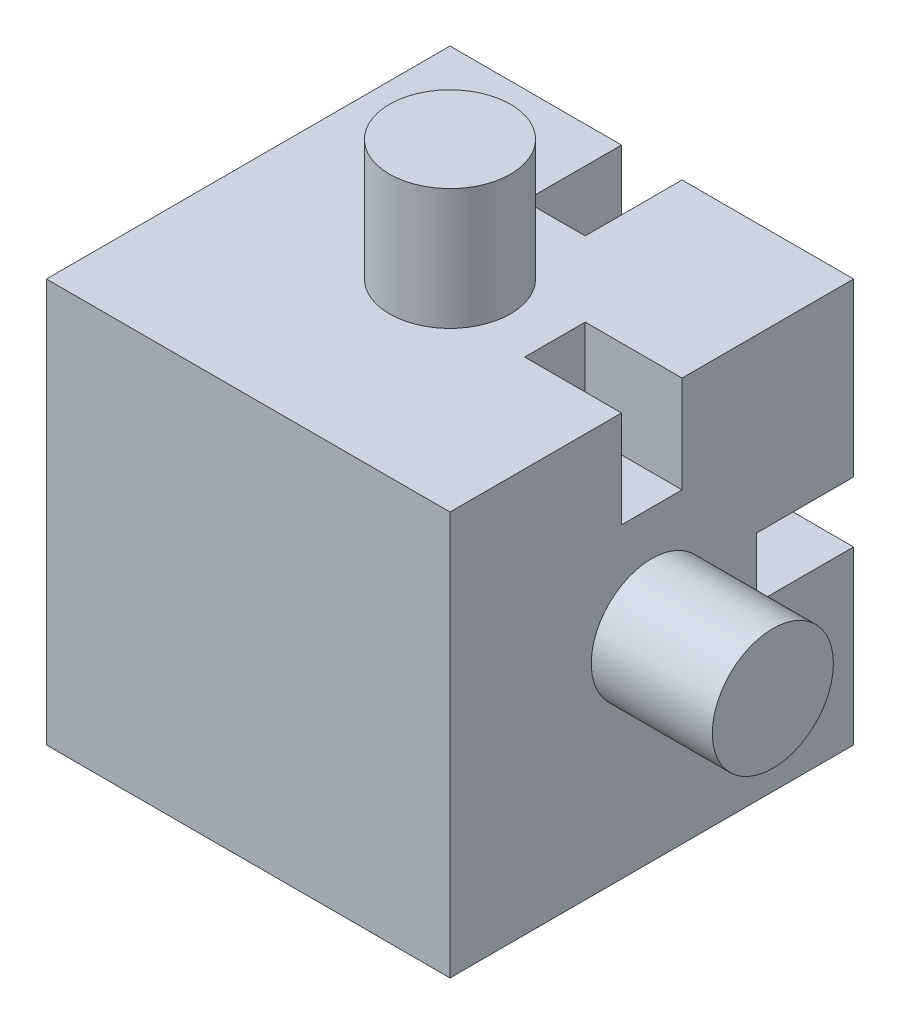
ISO-10303-21;
HEADER;
FILE_DESCRIPTION(('STEP AP214'),'2;1');
FILE_NAME('part.step','',(''),(''),'','','');
FILE_SCHEMA(('AUTOMOTIVE_DESIGN { 1 0 10303 214 1 1 1 1 }'));
ENDSEC;
DATA;
#1=APPLICATION_CONTEXT('core data for automotive mechanical design processes');
#2=APPLICATION_PROTOCOL_DEFINITION('international standard','automotive_design',2000,#1);
#3=PRODUCT_CONTEXT('',#1,'mechanical');
#4=PRODUCT('Part','Part','',(#3));
#5=PRODUCT_RELATED_PRODUCT_CATEGORY('part','',(#4));
#6=PRODUCT_DEFINITION_FORMATION('','',#4);
#7=PRODUCT_DEFINITION_CONTEXT('part definition',#1,'design');
#8=PRODUCT_DEFINITION('design','',#6,#7);
#9=PRODUCT_DEFINITION_SHAPE('','',#8);
#10=(LENGTH_UNIT() NAMED_UNIT(*) SI_UNIT(.MILLI.,.METRE.));
#11=(NAMED_UNIT(*) PLANE_ANGLE_UNIT() SI_UNIT($,.RADIAN.));
#12=(NAMED_UNIT(*) SI_UNIT($,.STERADIAN.) SOLID_ANGLE_UNIT());
#13=UNCERTAINTY_MEASURE_WITH_UNIT(LENGTH_MEASURE(1.E-05),#10,'distance_accuracy_value','');
#14=(GEOMETRIC_REPRESENTATION_CONTEXT(3) GLOBAL_UNCERTAINTY_ASSIGNED_CONTEXT((#13)) GLOBAL_UNIT_ASSIGNED_CONTEXT((#10,
#11,#12)) REPRESENTATION_CONTEXT('',''));
#15=CARTESIAN_POINT('',(0.,0.,0.));
#16=DIRECTION('',(0.,0.,1.));
#17=DIRECTION('',(1.,0.,0.));
#18=AXIS2_PLACEMENT_3D('',#15,#16,#17);
#19=CARTESIAN_POINT('',(0.,0.,-10.));
#20=DIRECTION('',(0.,0.,-1.));
#21=DIRECTION('',(-1.,0.,0.));
#22=AXIS2_PLACEMENT_3D('',#19,#20,#21);
#23=PLANE('',#22);
#24=CARTESIAN_POINT('',(0.,0.,-10.));
#25=DIRECTION('',(0.,0.,-1.));
#26=DIRECTION('',(-1.,0.,0.));
#27=AXIS2_PLACEMENT_3D('',#24,#25,#26);
#28=CIRCLE('',#27,3.);
#29=CARTESIAN_POINT('',(-3.,0.,-10.));
#30=VERTEX_POINT('',#29);
#31=EDGE_CURVE('E237',#30,#30,#28,.T.);
#32=ORIENTED_EDGE('',*,*,#31,.F.);
#33=EDGE_LOOP('',(#32));
#34=FACE_BOUND('',#33,.T.);
#35=DIRECTION('',(-1.,0.,0.));
#36=VECTOR('',#35,1.);
#37=CARTESIAN_POINT('',(1.5,5.2,-10.));
#38=LINE('',#37,#36);
#39=CARTESIAN_POINT('',(1.5,5.2,-10.));
#40=VERTEX_POINT('',#39);
#41=CARTESIAN_POINT('',(-1.5,5.2,-10.));
#42=VERTEX_POINT('',#41);
#43=EDGE_CURVE('E172',#40,#42,#38,.T.);
#44=ORIENTED_EDGE('',*,*,#43,.F.);
#45=DIRECTION('',(0.,1.,0.));
#46=VECTOR('',#45,1.);
#47=CARTESIAN_POINT('',(1.5,10.,-10.));
#48=LINE('',#47,#46);
#49=CARTESIAN_POINT('',(1.5,10.,-10.));
#50=VERTEX_POINT('',#49);
#51=EDGE_CURVE('E307',#40,#50,#48,.T.);
#52=ORIENTED_EDGE('',*,*,#51,.T.);
#53=DIRECTION('',(-1.,0.,0.));
#54=VECTOR('',#53,1.);
#55=CARTESIAN_POINT('',(-10.,10.,-10.));
#56=LINE('',#55,#54);
#57=CARTESIAN_POINT('',(10.,10.,-10.));
#58=VERTEX_POINT('',#57);
#59=EDGE_CURVE('E262',#58,#50,#56,.T.);
#60=ORIENTED_EDGE('',*,*,#59,.F.);
#61=DIRECTION('',(0.,1.,0.));
#62=VECTOR('',#61,1.);
#63=CARTESIAN_POINT('',(10.,-10.,-10.));
#64=LINE('',#63,#62);
#65=CARTESIAN_POINT('',(10.,1.5,-10.));
#66=VERTEX_POINT('',#65);
#67=EDGE_CURVE('E257',#66,#58,#64,.T.);
#68=ORIENTED_EDGE('',*,*,#67,.F.);
#69=DIRECTION('',(-1.,0.,0.));
#70=VECTOR('',#69,1.);
#71=CARTESIAN_POINT('',(10.,1.5,-10.));
#72=LINE('',#71,#70);
#73=CARTESIAN_POINT('',(5.2,1.5,-10.));
#74=VERTEX_POINT('',#73);
#75=EDGE_CURVE('E185',#66,#74,#72,.T.);
#76=ORIENTED_EDGE('',*,*,#75,.T.);
#77=DIRECTION('',(0.,-1.,0.));
#78=VECTOR('',#77,1.);
#79=CARTESIAN_POINT('',(5.2,1.5,-10.));
#80=LINE('',#79,#78);
#81=CARTESIAN_POINT('',(5.2,-1.5,-10.));
#82=VERTEX_POINT('',#81);
#83=EDGE_CURVE('E196',#74,#82,#80,.T.);
#84=ORIENTED_EDGE('',*,*,#83,.T.);
#85=DIRECTION('',(-1.,0.,0.));
#86=VECTOR('',#85,1.);
#87=CARTESIAN_POINT('',(10.,-1.5,-10.));
#88=LINE('',#87,#86);
#89=CARTESIAN_POINT('',(10.,-1.5,-10.));
#90=VERTEX_POINT('',#89);
#91=EDGE_CURVE('E170',#90,#82,#88,.T.);
#92=ORIENTED_EDGE('',*,*,#91,.F.);
#93=CARTESIAN_POINT('',(10.,-10.,-10.));
#94=VERTEX_POINT('',#93);
#95=EDGE_CURVE('E258',#94,#90,#64,.T.);
#96=ORIENTED_EDGE('',*,*,#95,.F.);
#97=DIRECTION('',(1.,0.,0.));
#98=VECTOR('',#97,1.);
#99=CARTESIAN_POINT('',(-10.,-10.,-10.));
#100=LINE('',#99,#98);
#101=CARTESIAN_POINT('',(-10.,-10.,-10.));
#102=VERTEX_POINT('',#101);
#103=EDGE_CURVE('E267',#102,#94,#100,.T.);
#104=ORIENTED_EDGE('',*,*,#103,.F.);
#105=DIRECTION('',(0.,-1.,0.));
#106=VECTOR('',#105,1.);
#107=CARTESIAN_POINT('',(-10.,-10.,-10.));
#108=LINE('',#107,#106);
#109=CARTESIAN_POINT('',(-10.,10.,-10.));
#110=VERTEX_POINT('',#109);
#111=EDGE_CURVE('E264',#110,#102,#108,.T.);
#112=ORIENTED_EDGE('',*,*,#111,.F.);
#113=CARTESIAN_POINT('',(-1.5,10.,-10.));
#114=VERTEX_POINT('',#113);
#115=EDGE_CURVE('E261',#114,#110,#56,.T.);
#116=ORIENTED_EDGE('',*,*,#115,.F.);
#117=DIRECTION('',(0.,1.,0.));
#118=VECTOR('',#117,1.);
#119=CARTESIAN_POINT('',(-1.5,10.,-10.));
#120=LINE('',#119,#118);
#121=EDGE_CURVE('E50',#42,#114,#120,.T.);
#122=ORIENTED_EDGE('',*,*,#121,.F.);
#123=EDGE_LOOP('',(#44,#52,#60,#68,#76,#84,#92,#96,#104,#112,#116,#122));
#124=FACE_BOUND('',#123,.T.);
#125=ADVANCED_FACE('F33',(#34,#124),#23,.T.);
#126=CARTESIAN_POINT('',(-10.,10.,-10.));
#127=DIRECTION('',(0.,1.,0.));
#128=DIRECTION('',(0.,0.,1.));
#129=AXIS2_PLACEMENT_3D('',#126,#127,#128);
#130=PLANE('',#129);
#131=CARTESIAN_POINT('',(0.,10.,0.));
#132=DIRECTION('',(0.,1.,0.));
#133=DIRECTION('',(0.,0.,1.));
#134=AXIS2_PLACEMENT_3D('',#131,#132,#133);
#135=CIRCLE('',#134,3.);
#136=CARTESIAN_POINT('',(0.,10.,3.));
#137=VERTEX_POINT('',#136);
#138=EDGE_CURVE('E231',#137,#137,#135,.T.);
#139=ORIENTED_EDGE('',*,*,#138,.F.);
#140=EDGE_LOOP('',(#139));
#141=FACE_BOUND('',#140,.T.);
#142=ORIENTED_EDGE('',*,*,#59,.T.);
#143=DIRECTION('',(0.,0.,1.));
#144=VECTOR('',#143,1.);
#145=CARTESIAN_POINT('',(1.5,10.,-10.));
#146=LINE('',#145,#144);
#147=CARTESIAN_POINT('',(1.5,10.,-5.2));
#148=VERTEX_POINT('',#147);
#149=EDGE_CURVE('E168',#50,#148,#146,.T.);
#150=ORIENTED_EDGE('',*,*,#149,.T.);
#151=DIRECTION('',(-1.,0.,0.));
#152=VECTOR('',#151,1.);
#153=CARTESIAN_POINT('',(1.5,10.,-5.2));
#154=LINE('',#153,#152);
#155=CARTESIAN_POINT('',(-1.5,10.,-5.2));
#156=VERTEX_POINT('',#155);
#157=EDGE_CURVE('E153',#148,#156,#154,.T.);
#158=ORIENTED_EDGE('',*,*,#157,.T.);
#159=DIRECTION('',(0.,0.,1.));
#160=VECTOR('',#159,1.);
#161=CARTESIAN_POINT('',(-1.5,10.,-10.));
#162=LINE('',#161,#160);
#163=EDGE_CURVE('E159',#114,#156,#162,.T.);
#164=ORIENTED_EDGE('',*,*,#163,.F.);
#165=ORIENTED_EDGE('',*,*,#115,.T.);
#166=DIRECTION('',(0.,0.,1.));
#167=VECTOR('',#166,1.);
#168=CARTESIAN_POINT('',(-10.,10.,-10.));
#169=LINE('',#168,#167);
#170=CARTESIAN_POINT('',(-10.,10.,10.));
#171=VERTEX_POINT('',#170);
#172=EDGE_CURVE('E271',#110,#171,#169,.T.);
#173=ORIENTED_EDGE('',*,*,#172,.T.);
#174=DIRECTION('',(-1.,0.,0.));
#175=VECTOR('',#174,1.);
#176=CARTESIAN_POINT('',(-10.,10.,10.));
#177=LINE('',#176,#175);
#178=CARTESIAN_POINT('',(10.,10.,10.));
#179=VERTEX_POINT('',#178);
#180=EDGE_CURVE('E248',#179,#171,#177,.T.);
#181=ORIENTED_EDGE('',*,*,#180,.F.);
#182=DIRECTION('',(0.,0.,1.));
#183=VECTOR('',#182,1.);
#184=CARTESIAN_POINT('',(10.,10.,-10.));
#185=LINE('',#184,#183);
#186=CARTESIAN_POINT('',(10.,10.,1.5));
#187=VERTEX_POINT('',#186);
#188=EDGE_CURVE('E269',#187,#179,#185,.T.);
#189=ORIENTED_EDGE('',*,*,#188,.F.);
#190=DIRECTION('',(-1.,0.,0.));
#191=VECTOR('',#190,1.);
#192=CARTESIAN_POINT('',(10.,10.,1.5));
#193=LINE('',#192,#191);
#194=CARTESIAN_POINT('',(5.2,10.,1.5));
#195=VERTEX_POINT('',#194);
#196=EDGE_CURVE('E213',#187,#195,#193,.T.);
#197=ORIENTED_EDGE('',*,*,#196,.T.);
#198=DIRECTION('',(0.,0.,-1.));
#199=VECTOR('',#198,1.);
#200=CARTESIAN_POINT('',(5.2,10.,1.5));
#201=LINE('',#200,#199);
#202=CARTESIAN_POINT('',(5.2,10.,-1.5));
#203=VERTEX_POINT('',#202);
#204=EDGE_CURVE('E224',#195,#203,#201,.T.);
#205=ORIENTED_EDGE('',*,*,#204,.T.);
#206=DIRECTION('',(-1.,0.,0.));
#207=VECTOR('',#206,1.);
#208=CARTESIAN_POINT('',(10.,10.,-1.5));
#209=LINE('',#208,#207);
#210=CARTESIAN_POINT('',(10.,10.,-1.5));
#211=VERTEX_POINT('',#210);
#212=EDGE_CURVE('E201',#211,#203,#209,.T.);
#213=ORIENTED_EDGE('',*,*,#212,.F.);
#214=EDGE_CURVE('E37',#58,#211,#185,.T.);
#215=ORIENTED_EDGE('',*,*,#214,.F.);
#216=EDGE_LOOP('',(#142,#150,#158,#164,#165,#173,#181,#189,#197,#205,#213,#215));
#217=FACE_BOUND('',#216,.T.);
#218=ADVANCED_FACE('F167',(#141,#217),#130,.T.);
#219=CARTESIAN_POINT('',(10.,-10.,-10.));
#220=DIRECTION('',(1.,0.,0.));
#221=DIRECTION('',(0.,0.,-1.));
#222=AXIS2_PLACEMENT_3D('',#219,#220,#221);
#223=PLANE('',#222);
#224=CARTESIAN_POINT('',(10.,0.,0.));
#225=DIRECTION('',(1.,0.,0.));
#226=DIRECTION('',(0.,0.,-1.));
#227=AXIS2_PLACEMENT_3D('',#224,#225,#226);
#228=CIRCLE('',#227,3.);
#229=CARTESIAN_POINT('',(10.,0.,-3.));
#230=VERTEX_POINT('',#229);
#231=EDGE_CURVE('E227',#230,#230,#228,.T.);
#232=ORIENTED_EDGE('',*,*,#231,.F.);
#233=EDGE_LOOP('',(#232));
#234=FACE_BOUND('',#233,.T.);
#235=DIRECTION('',(0.,-1.,0.));
#236=VECTOR('',#235,1.);
#237=CARTESIAN_POINT('',(10.,1.5,-5.2));
#238=LINE('',#237,#236);
#239=CARTESIAN_POINT('',(10.,1.5,-5.2));
#240=VERTEX_POINT('',#239);
#241=CARTESIAN_POINT('',(10.,-1.5,-5.2));
#242=VERTEX_POINT('',#241);
#243=EDGE_CURVE('E192',#240,#242,#238,.T.);
#244=ORIENTED_EDGE('',*,*,#243,.F.);
#245=DIRECTION('',(0.,0.,-1.));
#246=VECTOR('',#245,1.);
#247=CARTESIAN_POINT('',(10.,1.5,-10.));
#248=LINE('',#247,#246);
#249=EDGE_CURVE('E182',#240,#66,#248,.T.);
#250=ORIENTED_EDGE('',*,*,#249,.T.);
#251=ORIENTED_EDGE('',*,*,#67,.T.);
#252=ORIENTED_EDGE('',*,*,#214,.T.);
#253=DIRECTION('',(0.,1.,0.));
#254=VECTOR('',#253,1.);
#255=CARTESIAN_POINT('',(10.,10.,-1.5));
#256=LINE('',#255,#254);
#257=CARTESIAN_POINT('',(10.,5.2,-1.5));
#258=VERTEX_POINT('',#257);
#259=EDGE_CURVE('E199',#258,#211,#256,.T.);
#260=ORIENTED_EDGE('',*,*,#259,.F.);
#261=DIRECTION('',(0.,0.,-1.));
#262=VECTOR('',#261,1.);
#263=CARTESIAN_POINT('',(10.,5.2,1.5));
#264=LINE('',#263,#262);
#265=CARTESIAN_POINT('',(10.,5.2,1.5));
#266=VERTEX_POINT('',#265);
#267=EDGE_CURVE('E220',#266,#258,#264,.T.);
#268=ORIENTED_EDGE('',*,*,#267,.F.);
#269=DIRECTION('',(0.,1.,0.));
#270=VECTOR('',#269,1.);
#271=CARTESIAN_POINT('',(10.,10.,1.5));
#272=LINE('',#271,#270);
#273=EDGE_CURVE('E210',#266,#187,#272,.T.);
#274=ORIENTED_EDGE('',*,*,#273,.T.);
#275=ORIENTED_EDGE('',*,*,#188,.T.);
#276=DIRECTION('',(0.,1.,0.));
#277=VECTOR('',#276,1.);
#278=CARTESIAN_POINT('',(10.,-10.,10.));
#279=LINE('',#278,#277);
#280=CARTESIAN_POINT('',(10.,-10.,10.));
#281=VERTEX_POINT('',#280);
#282=EDGE_CURVE('E243',#281,#179,#279,.T.);
#283=ORIENTED_EDGE('',*,*,#282,.F.);
#284=DIRECTION('',(0.,0.,1.));
#285=VECTOR('',#284,1.);
#286=CARTESIAN_POINT('',(10.,-10.,-10.));
#287=LINE('',#286,#285);
#288=EDGE_CURVE('E11',#94,#281,#287,.T.);
#289=ORIENTED_EDGE('',*,*,#288,.F.);
#290=ORIENTED_EDGE('',*,*,#95,.T.);
#291=DIRECTION('',(0.,0.,-1.));
#292=VECTOR('',#291,1.);
#293=CARTESIAN_POINT('',(10.,-1.5,-10.));
#294=LINE('',#293,#292);
#295=EDGE_CURVE('E58',#242,#90,#294,.T.);
#296=ORIENTED_EDGE('',*,*,#295,.F.);
#297=EDGE_LOOP('',(#244,#250,#251,#252,#260,#268,#274,#275,#283,#289,#290,#296));
#298=FACE_BOUND('',#297,.T.);
#299=ADVANCED_FACE('F35',(#234,#298),#223,.T.);
#300=CARTESIAN_POINT('',(-10.,-10.,-10.));
#301=DIRECTION('',(0.,-1.,0.));
#302=DIRECTION('',(0.,0.,-1.));
#303=AXIS2_PLACEMENT_3D('',#300,#301,#302);
#304=PLANE('',#303);
#305=ORIENTED_EDGE('',*,*,#288,.T.);
#306=DIRECTION('',(1.,0.,0.));
#307=VECTOR('',#306,1.);
#308=CARTESIAN_POINT('',(-10.,-10.,10.));
#309=LINE('',#308,#307);
#310=CARTESIAN_POINT('',(-10.,-10.,10.));
#311=VERTEX_POINT('',#310);
#312=EDGE_CURVE('E254',#311,#281,#309,.T.);
#313=ORIENTED_EDGE('',*,*,#312,.F.);
#314=DIRECTION('',(0.,0.,1.));
#315=VECTOR('',#314,1.);
#316=CARTESIAN_POINT('',(-10.,-10.,-10.));
#317=LINE('',#316,#315);
#318=EDGE_CURVE('E42',#102,#311,#317,.T.);
#319=ORIENTED_EDGE('',*,*,#318,.F.);
#320=ORIENTED_EDGE('',*,*,#103,.T.);
#321=EDGE_LOOP('',(#305,#313,#319,#320));
#322=FACE_BOUND('',#321,.T.);
#323=ADVANCED_FACE('F288',(#322),#304,.T.);
#324=CARTESIAN_POINT('',(-10.,-10.,-10.));
#325=DIRECTION('',(-1.,0.,0.));
#326=DIRECTION('',(0.,0.,1.));
#327=AXIS2_PLACEMENT_3D('',#324,#325,#326);
#328=PLANE('',#327);
#329=ORIENTED_EDGE('',*,*,#318,.T.);
#330=DIRECTION('',(0.,-1.,0.));
#331=VECTOR('',#330,1.);
#332=CARTESIAN_POINT('',(-10.,-10.,10.));
#333=LINE('',#332,#331);
#334=EDGE_CURVE('E251',#171,#311,#333,.T.);
#335=ORIENTED_EDGE('',*,*,#334,.F.);
#336=ORIENTED_EDGE('',*,*,#172,.F.);
#337=ORIENTED_EDGE('',*,*,#111,.T.);
#338=EDGE_LOOP('',(#329,#335,#336,#337));
#339=FACE_BOUND('',#338,.T.);
#340=ADVANCED_FACE('F345',(#339),#328,.T.);
#341=CARTESIAN_POINT('',(0.,0.,10.));
#342=DIRECTION('',(0.,0.,-1.));
#343=DIRECTION('',(-1.,0.,0.));
#344=AXIS2_PLACEMENT_3D('',#341,#342,#343);
#345=PLANE('',#344);
#346=ORIENTED_EDGE('',*,*,#282,.T.);
#347=ORIENTED_EDGE('',*,*,#180,.T.);
#348=ORIENTED_EDGE('',*,*,#334,.T.);
#349=ORIENTED_EDGE('',*,*,#312,.T.);
#350=EDGE_LOOP('',(#346,#347,#348,#349));
#351=FACE_BOUND('',#350,.T.);
#352=ADVANCED_FACE('F285',(#351),#345,.F.);
#353=CARTESIAN_POINT('',(0.,0.,-16.));
#354=DIRECTION('',(0.,0.,1.));
#355=DIRECTION('',(1.,0.,0.));
#356=AXIS2_PLACEMENT_3D('',#353,#354,#355);
#357=CYLINDRICAL_SURFACE('',#356,3.);
#358=CARTESIAN_POINT('',(0.,0.,-16.));
#359=DIRECTION('',(0.,0.,-1.));
#360=DIRECTION('',(-1.,0.,0.));
#361=AXIS2_PLACEMENT_3D('',#358,#359,#360);
#362=CIRCLE('',#361,3.);
#363=CARTESIAN_POINT('',(-3.,0.,-16.));
#364=VERTEX_POINT('',#363);
#365=EDGE_CURVE('E240',#364,#364,#362,.T.);
#366=ORIENTED_EDGE('',*,*,#365,.F.);
#367=EDGE_LOOP('',(#366));
#368=FACE_BOUND('',#367,.T.);
#369=ORIENTED_EDGE('',*,*,#31,.T.);
#370=EDGE_LOOP('',(#369));
#371=FACE_BOUND('',#370,.T.);
#372=ADVANCED_FACE('F351',(#368,#371),#357,.T.);
#373=CARTESIAN_POINT('',(0.,0.,-16.));
#374=DIRECTION('',(0.,0.,-1.));
#375=DIRECTION('',(-1.,0.,0.));
#376=AXIS2_PLACEMENT_3D('',#373,#374,#375);
#377=PLANE('',#376);
#378=ORIENTED_EDGE('',*,*,#365,.T.);
#379=EDGE_LOOP('',(#378));
#380=FACE_BOUND('',#379,.T.);
#381=ADVANCED_FACE('F502',(#380),#377,.T.);
#382=CARTESIAN_POINT('',(0.,16.,0.));
#383=DIRECTION('',(0.,-1.,0.));
#384=DIRECTION('',(0.,0.,-1.));
#385=AXIS2_PLACEMENT_3D('',#382,#383,#384);
#386=CYLINDRICAL_SURFACE('',#385,3.);
#387=CARTESIAN_POINT('',(0.,16.,0.));
#388=DIRECTION('',(0.,1.,0.));
#389=DIRECTION('',(0.,0.,1.));
#390=AXIS2_PLACEMENT_3D('',#387,#388,#389);
#391=CIRCLE('',#390,3.);
#392=CARTESIAN_POINT('',(0.,16.,3.));
#393=VERTEX_POINT('',#392);
#394=EDGE_CURVE('E234',#393,#393,#391,.T.);
#395=ORIENTED_EDGE('',*,*,#394,.F.);
#396=EDGE_LOOP('',(#395));
#397=FACE_BOUND('',#396,.T.);
#398=ORIENTED_EDGE('',*,*,#138,.T.);
#399=EDGE_LOOP('',(#398));
#400=FACE_BOUND('',#399,.T.);
#401=ADVANCED_FACE('F493',(#397,#400),#386,.T.);
#402=CARTESIAN_POINT('',(0.,16.,0.));
#403=DIRECTION('',(0.,1.,0.));
#404=DIRECTION('',(0.,0.,1.));
#405=AXIS2_PLACEMENT_3D('',#402,#403,#404);
#406=PLANE('',#405);
#407=ORIENTED_EDGE('',*,*,#394,.T.);
#408=EDGE_LOOP('',(#407));
#409=FACE_BOUND('',#408,.T.);
#410=ADVANCED_FACE('F484',(#409),#406,.T.);
#411=CARTESIAN_POINT('',(16.,0.,0.));
#412=DIRECTION('',(-1.,0.,0.));
#413=DIRECTION('',(0.,0.,1.));
#414=AXIS2_PLACEMENT_3D('',#411,#412,#413);
#415=CYLINDRICAL_SURFACE('',#414,3.);
#416=CARTESIAN_POINT('',(16.,0.,0.));
#417=DIRECTION('',(1.,0.,0.));
#418=DIRECTION('',(0.,0.,-1.));
#419=AXIS2_PLACEMENT_3D('',#416,#417,#418);
#420=CIRCLE('',#419,3.);
#421=CARTESIAN_POINT('',(16.,0.,-3.));
#422=VERTEX_POINT('',#421);
#423=EDGE_CURVE('E228',#422,#422,#420,.T.);
#424=ORIENTED_EDGE('',*,*,#423,.F.);
#425=EDGE_LOOP('',(#424));
#426=FACE_BOUND('',#425,.T.);
#427=ORIENTED_EDGE('',*,*,#231,.T.);
#428=EDGE_LOOP('',(#427));
#429=FACE_BOUND('',#428,.T.);
#430=ADVANCED_FACE('F329',(#426,#429),#415,.T.);
#431=CARTESIAN_POINT('',(16.,0.,0.));
#432=DIRECTION('',(1.,0.,0.));
#433=DIRECTION('',(0.,0.,-1.));
#434=AXIS2_PLACEMENT_3D('',#431,#432,#433);
#435=PLANE('',#434);
#436=ORIENTED_EDGE('',*,*,#423,.T.);
#437=EDGE_LOOP('',(#436));
#438=FACE_BOUND('',#437,.T.);
#439=ADVANCED_FACE('F322',(#438),#435,.T.);
#440=CARTESIAN_POINT('',(5.2,10.,1.5));
#441=DIRECTION('',(1.,0.,0.));
#442=DIRECTION('',(0.,1.,0.));
#443=AXIS2_PLACEMENT_3D('',#440,#441,#442);
#444=PLANE('',#443);
#445=ORIENTED_EDGE('',*,*,#204,.F.);
#446=DIRECTION('',(0.,-1.,0.));
#447=VECTOR('',#446,1.);
#448=CARTESIAN_POINT('',(5.2,10.,1.5));
#449=LINE('',#448,#447);
#450=CARTESIAN_POINT('',(5.20000000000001,5.2,1.5));
#451=VERTEX_POINT('',#450);
#452=EDGE_CURVE('E216',#195,#451,#449,.T.);
#453=ORIENTED_EDGE('',*,*,#452,.T.);
#454=DIRECTION('',(0.,0.,-1.));
#455=VECTOR('',#454,1.);
#456=CARTESIAN_POINT('',(5.20000000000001,5.2,1.5));
#457=LINE('',#456,#455);
#458=CARTESIAN_POINT('',(5.20000000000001,5.2,-1.5));
#459=VERTEX_POINT('',#458);
#460=EDGE_CURVE('E222',#451,#459,#457,.T.);
#461=ORIENTED_EDGE('',*,*,#460,.T.);
#462=DIRECTION('',(0.,-1.,0.));
#463=VECTOR('',#462,1.);
#464=CARTESIAN_POINT('',(5.2,10.,-1.5));
#465=LINE('',#464,#463);
#466=EDGE_CURVE('E204',#203,#459,#465,.T.);
#467=ORIENTED_EDGE('',*,*,#466,.F.);
#468=EDGE_LOOP('',(#445,#453,#461,#467));
#469=FACE_BOUND('',#468,.T.);
#470=ADVANCED_FACE('F320',(#469),#444,.T.);
#471=CARTESIAN_POINT('',(10.,5.2,1.5));
#472=DIRECTION('',(0.,1.,0.));
#473=DIRECTION('',(0.,0.,1.));
#474=AXIS2_PLACEMENT_3D('',#471,#472,#473);
#475=PLANE('',#474);
#476=ORIENTED_EDGE('',*,*,#460,.F.);
#477=DIRECTION('',(1.,0.,0.));
#478=VECTOR('',#477,1.);
#479=CARTESIAN_POINT('',(10.,5.2,1.5));
#480=LINE('',#479,#478);
#481=EDGE_CURVE('E218',#451,#266,#480,.T.);
#482=ORIENTED_EDGE('',*,*,#481,.T.);
#483=ORIENTED_EDGE('',*,*,#267,.T.);
#484=DIRECTION('',(1.,0.,0.));
#485=VECTOR('',#484,1.);
#486=CARTESIAN_POINT('',(10.,5.2,-1.5));
#487=LINE('',#486,#485);
#488=EDGE_CURVE('E207',#459,#258,#487,.T.);
#489=ORIENTED_EDGE('',*,*,#488,.F.);
#490=EDGE_LOOP('',(#476,#482,#483,#489));
#491=FACE_BOUND('',#490,.T.);
#492=ADVANCED_FACE('F314',(#491),#475,.T.);
#493=CARTESIAN_POINT('',(0.,0.,1.5));
#494=DIRECTION('',(0.,0.,-1.));
#495=DIRECTION('',(-1.,0.,0.));
#496=AXIS2_PLACEMENT_3D('',#493,#494,#495);
#497=PLANE('',#496);
#498=ORIENTED_EDGE('',*,*,#273,.F.);
#499=ORIENTED_EDGE('',*,*,#481,.F.);
#500=ORIENTED_EDGE('',*,*,#452,.F.);
#501=ORIENTED_EDGE('',*,*,#196,.F.);
#502=EDGE_LOOP('',(#498,#499,#500,#501));
#503=FACE_BOUND('',#502,.T.);
#504=ADVANCED_FACE('F318',(#503),#497,.T.);
#505=CARTESIAN_POINT('',(0.,0.,-1.5));
#506=DIRECTION('',(0.,0.,-1.));
#507=DIRECTION('',(-1.,0.,0.));
#508=AXIS2_PLACEMENT_3D('',#505,#506,#507);
#509=PLANE('',#508);
#510=ORIENTED_EDGE('',*,*,#259,.T.);
#511=ORIENTED_EDGE('',*,*,#212,.T.);
#512=ORIENTED_EDGE('',*,*,#466,.T.);
#513=ORIENTED_EDGE('',*,*,#488,.T.);
#514=EDGE_LOOP('',(#510,#511,#512,#513));
#515=FACE_BOUND('',#514,.T.);
#516=ADVANCED_FACE('F310',(#515),#509,.F.);
#517=CARTESIAN_POINT('',(5.2,1.5,-10.));
#518=DIRECTION('',(1.,0.,0.));
#519=DIRECTION('',(0.,0.,-1.));
#520=AXIS2_PLACEMENT_3D('',#517,#518,#519);
#521=PLANE('',#520);
#522=ORIENTED_EDGE('',*,*,#83,.F.);
#523=DIRECTION('',(0.,0.,1.));
#524=VECTOR('',#523,1.);
#525=CARTESIAN_POINT('',(5.2,1.5,-10.));
#526=LINE('',#525,#524);
#527=CARTESIAN_POINT('',(5.2,1.5,-5.2));
#528=VERTEX_POINT('',#527);
#529=EDGE_CURVE('E188',#74,#528,#526,.T.);
#530=ORIENTED_EDGE('',*,*,#529,.T.);
#531=DIRECTION('',(0.,-1.,0.));
#532=VECTOR('',#531,1.);
#533=CARTESIAN_POINT('',(5.2,1.5,-5.2));
#534=LINE('',#533,#532);
#535=CARTESIAN_POINT('',(5.2,-1.5,-5.2));
#536=VERTEX_POINT('',#535);
#537=EDGE_CURVE('E194',#528,#536,#534,.T.);
#538=ORIENTED_EDGE('',*,*,#537,.T.);
#539=DIRECTION('',(0.,0.,1.));
#540=VECTOR('',#539,1.);
#541=CARTESIAN_POINT('',(5.2,-1.5,-10.));
#542=LINE('',#541,#540);
#543=EDGE_CURVE('E177',#82,#536,#542,.T.);
#544=ORIENTED_EDGE('',*,*,#543,.F.);
#545=EDGE_LOOP('',(#522,#530,#538,#544));
#546=FACE_BOUND('',#545,.T.);
#547=ADVANCED_FACE('F383',(#546),#521,.T.);
#548=CARTESIAN_POINT('',(10.,1.5,-5.2));
#549=DIRECTION('',(0.,0.,-1.));
#550=DIRECTION('',(-1.,0.,0.));
#551=AXIS2_PLACEMENT_3D('',#548,#549,#550);
#552=PLANE('',#551);
#553=ORIENTED_EDGE('',*,*,#537,.F.);
#554=DIRECTION('',(1.,0.,0.));
#555=VECTOR('',#554,1.);
#556=CARTESIAN_POINT('',(10.,1.5,-5.2));
#557=LINE('',#556,#555);
#558=EDGE_CURVE('E190',#528,#240,#557,.T.);
#559=ORIENTED_EDGE('',*,*,#558,.T.);
#560=ORIENTED_EDGE('',*,*,#243,.T.);
#561=DIRECTION('',(1.,0.,0.));
#562=VECTOR('',#561,1.);
#563=CARTESIAN_POINT('',(10.,-1.5,-5.2));
#564=LINE('',#563,#562);
#565=EDGE_CURVE('E180',#536,#242,#564,.T.);
#566=ORIENTED_EDGE('',*,*,#565,.F.);
#567=EDGE_LOOP('',(#553,#559,#560,#566));
#568=FACE_BOUND('',#567,.T.);
#569=ADVANCED_FACE('F299',(#568),#552,.T.);
#570=CARTESIAN_POINT('',(0.,1.5,0.));
#571=DIRECTION('',(0.,-1.,0.));
#572=DIRECTION('',(0.,0.,-1.));
#573=AXIS2_PLACEMENT_3D('',#570,#571,#572);
#574=PLANE('',#573);
#575=ORIENTED_EDGE('',*,*,#249,.F.);
#576=ORIENTED_EDGE('',*,*,#558,.F.);
#577=ORIENTED_EDGE('',*,*,#529,.F.);
#578=ORIENTED_EDGE('',*,*,#75,.F.);
#579=EDGE_LOOP('',(#575,#576,#577,#578));
#580=FACE_BOUND('',#579,.T.);
#581=ADVANCED_FACE('F378',(#580),#574,.T.);
#582=CARTESIAN_POINT('',(0.,-1.5,0.));
#583=DIRECTION('',(0.,-1.,0.));
#584=DIRECTION('',(0.,0.,-1.));
#585=AXIS2_PLACEMENT_3D('',#582,#583,#584);
#586=PLANE('',#585);
#587=ORIENTED_EDGE('',*,*,#295,.T.);
#588=ORIENTED_EDGE('',*,*,#91,.T.);
#589=ORIENTED_EDGE('',*,*,#543,.T.);
#590=ORIENTED_EDGE('',*,*,#565,.T.);
#591=EDGE_LOOP('',(#587,#588,#589,#590));
#592=FACE_BOUND('',#591,.T.);
#593=ADVANCED_FACE('F294',(#592),#586,.F.);
#594=CARTESIAN_POINT('',(1.5,10.,-5.2));
#595=DIRECTION('',(0.,0.,-1.));
#596=DIRECTION('',(0.,1.,0.));
#597=AXIS2_PLACEMENT_3D('',#594,#595,#596);
#598=PLANE('',#597);
#599=ORIENTED_EDGE('',*,*,#157,.F.);
#600=DIRECTION('',(0.,-1.,0.));
#601=VECTOR('',#600,1.);
#602=CARTESIAN_POINT('',(1.5,10.,-5.2));
#603=LINE('',#602,#601);
#604=CARTESIAN_POINT('',(1.5,5.2,-5.2));
#605=VERTEX_POINT('',#604);
#606=EDGE_CURVE('E357',#148,#605,#603,.T.);
#607=ORIENTED_EDGE('',*,*,#606,.T.);
#608=DIRECTION('',(-1.,0.,0.));
#609=VECTOR('',#608,1.);
#610=CARTESIAN_POINT('',(1.5,5.2,-5.2));
#611=LINE('',#610,#609);
#612=CARTESIAN_POINT('',(-1.5,5.2,-5.2));
#613=VERTEX_POINT('',#612);
#614=EDGE_CURVE('E156',#605,#613,#611,.T.);
#615=ORIENTED_EDGE('',*,*,#614,.T.);
#616=DIRECTION('',(0.,-1.,0.));
#617=VECTOR('',#616,1.);
#618=CARTESIAN_POINT('',(-1.5,10.,-5.2));
#619=LINE('',#618,#617);
#620=EDGE_CURVE('E150',#156,#613,#619,.T.);
#621=ORIENTED_EDGE('',*,*,#620,.F.);
#622=EDGE_LOOP('',(#599,#607,#615,#621));
#623=FACE_BOUND('',#622,.T.);
#624=ADVANCED_FACE('F151',(#623),#598,.T.);
#625=CARTESIAN_POINT('',(1.5,5.2,-10.));
#626=DIRECTION('',(0.,1.,0.));
#627=DIRECTION('',(0.,0.,1.));
#628=AXIS2_PLACEMENT_3D('',#625,#626,#627);
#629=PLANE('',#628);
#630=ORIENTED_EDGE('',*,*,#614,.F.);
#631=DIRECTION('',(0.,0.,-1.));
#632=VECTOR('',#631,1.);
#633=CARTESIAN_POINT('',(1.5,5.2,-10.));
#634=LINE('',#633,#632);
#635=EDGE_CURVE('E359',#605,#40,#634,.T.);
#636=ORIENTED_EDGE('',*,*,#635,.T.);
#637=ORIENTED_EDGE('',*,*,#43,.T.);
#638=DIRECTION('',(0.,0.,-1.));
#639=VECTOR('',#638,1.);
#640=CARTESIAN_POINT('',(-1.5,5.2,-10.));
#641=LINE('',#640,#639);
#642=EDGE_CURVE('E158',#613,#42,#641,.T.);
#643=ORIENTED_EDGE('',*,*,#642,.F.);
#644=EDGE_LOOP('',(#630,#636,#637,#643));
#645=FACE_BOUND('',#644,.T.);
#646=ADVANCED_FACE('F361',(#645),#629,.T.);
#647=CARTESIAN_POINT('',(1.5,0.,0.));
#648=DIRECTION('',(-1.,0.,0.));
#649=DIRECTION('',(0.,0.,1.));
#650=AXIS2_PLACEMENT_3D('',#647,#648,#649);
#651=PLANE('',#650);
#652=ORIENTED_EDGE('',*,*,#51,.F.);
#653=ORIENTED_EDGE('',*,*,#635,.F.);
#654=ORIENTED_EDGE('',*,*,#606,.F.);
#655=ORIENTED_EDGE('',*,*,#149,.F.);
#656=EDGE_LOOP('',(#652,#653,#654,#655));
#657=FACE_BOUND('',#656,.T.);
#658=ADVANCED_FACE('F364',(#657),#651,.T.);
#659=CARTESIAN_POINT('',(-1.5,0.,0.));
#660=DIRECTION('',(-1.,0.,0.));
#661=DIRECTION('',(0.,0.,1.));
#662=AXIS2_PLACEMENT_3D('',#659,#660,#661);
#663=PLANE('',#662);
#664=ORIENTED_EDGE('',*,*,#121,.T.);
#665=ORIENTED_EDGE('',*,*,#163,.T.);
#666=ORIENTED_EDGE('',*,*,#620,.T.);
#667=ORIENTED_EDGE('',*,*,#642,.T.);
#668=EDGE_LOOP('',(#664,#665,#666,#667));
#669=FACE_BOUND('',#668,.T.);
#670=ADVANCED_FACE('F161',(#669),#663,.F.);
#671=CLOSED_SHELL('',(#125,#218,#299,#323,#340,#352,#372,#381,#401,#410,#430,#439,#470,#492,
#504,#516,#547,#569,#581,#593,#624,#646,#658,#670));
#672=MANIFOLD_SOLID_BREP('B2',#671);
#673=ADVANCED_BREP_SHAPE_REPRESENTATION('',(#18,#672),#14);
#674=SHAPE_DEFINITION_REPRESENTATION(#9,#673);
ENDSEC;
END-ISO-10303-21;
